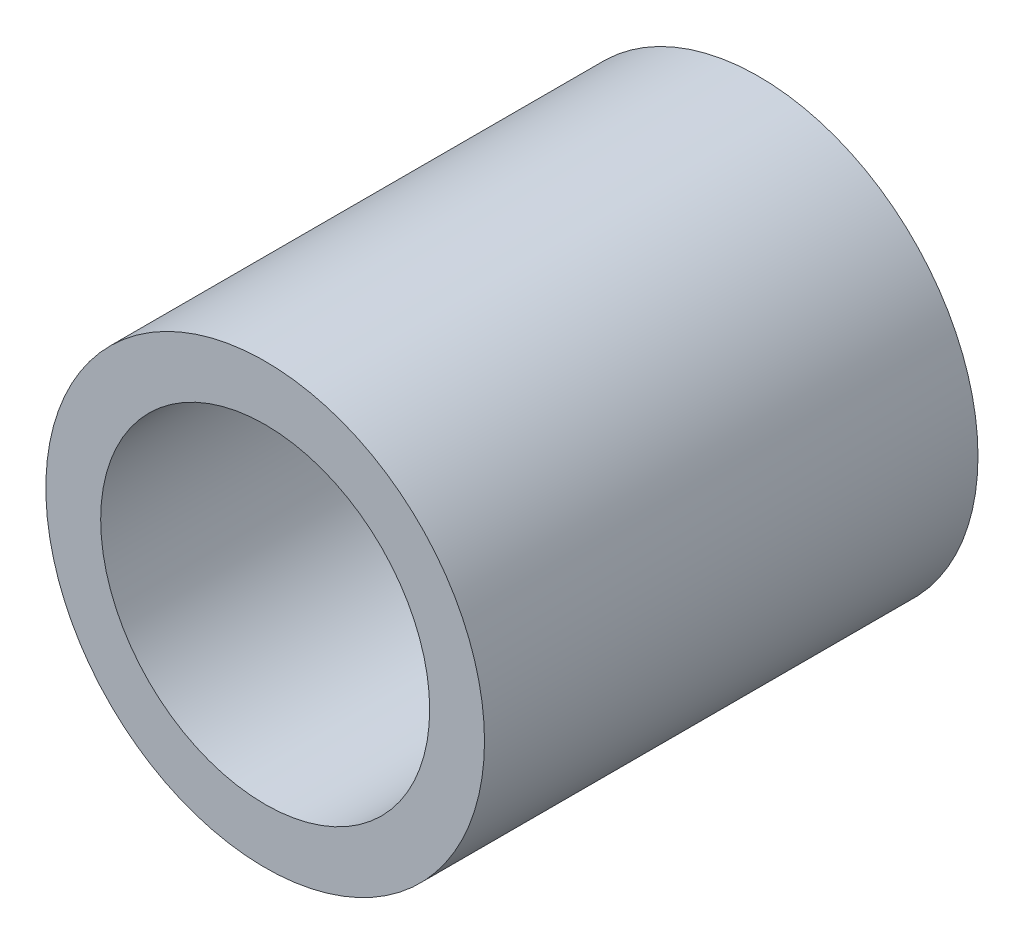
from build123d import *

# Parameters (mm, degrees)
SKETCH1_R          = 12.7
BASE_EXTRUDE_DEPTH = 28.575
SKETCH2_R          = 9.525
CUT_EXTRUDE1_DEPTH = 34.750712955


with BuildPart() as part:
    # Sketch1 → Base-Extrude (new body)
    with BuildSketch(Plane.XY):
        Circle(SKETCH1_R)
    extrude(amount=BASE_EXTRUDE_DEPTH)

    # Sketch2 → Cut-Extrude1 (cut, through all)
    with BuildSketch(Plane.XY.offset(28.575)):
        Circle(SKETCH2_R)
    extrude(amount=-CUT_EXTRUDE1_DEPTH, mode=Mode.SUBTRACT)


solid = part.part
